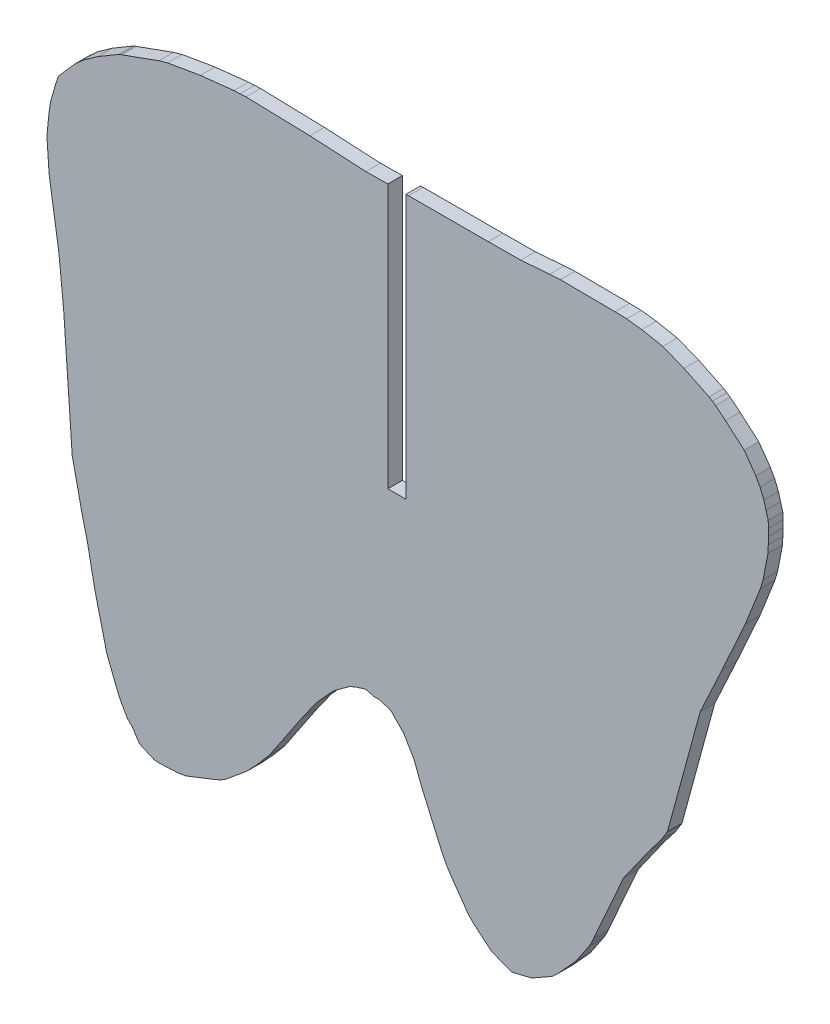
from build123d import *

# Parameters (mm, degrees)
EXTRUDE_1_DEPTH = 2


with BuildPart() as part:
    # Model → Extrude 1 (new body)
    with BuildSketch(Plane.XY):
        Polygon((-6154.0155, 147.3107), (-6153.9786, 148.3382), (-6154.0006, 149.2709), (-6154.0227, 150.2036), (-6154.3248, 151.2813), (-6154.627, 152.359), (-6155.1529, 153.6331), (-6155.7398, 154.6803), (-6157.3282, 156.9238), (-6159.8905, 159.1452), (-6161.2616, 160.2672), (-6161.712, 160.5626), (-6162.1623, 160.8581), (-6165.6062, 162.5244), (-6168.5288, 163.6722), (-6171.4089, 164.2268), (-6173.4835, 164.478), (-6175.0912, 164.5199), (-6182.5921, 164.5797), (-6184.0721, 164.4899), (-6188.0426, 164.1824), (-6192.5081, 164.1544), (-6203.4691, 164.1391), (-6203.822, 164.1358), (-6203.822, 127.8223), (-6204.072, 127.8223), (-6206.072, 127.8223), (-6206.322, 127.8223), (-6206.322, 164.1123), (-6209.3314, 164.084), (-6217.0414, 164.4924), (-6225.8253, 164.733), (-6226.6393, 164.6966), (-6227.4737, 164.6607), (-6232.0853, 164.158), (-6236.5897, 163.3913), (-6237.7896, 163.0485), (-6242.8884, 161.2083), (-6243.0811, 161.1346), (-6243.274, 161.0609), (-6243.3341, 161.0323), (-6246.2064, 159.3331), (-6248.2147, 157.9072), (-6249.398, 156.8311), (-6251.5172, 154.4147), (-6251.589, 154.2861), (-6251.6609, 154.1575), (-6251.8158, 153.6917), (-6251.9706, 153.226), (-6252.7059, 150.6364), (-6252.8126, 149.8839), (-6252.9194, 149.1313), (-6253.1862, 146.377), (-6252.8824, 141.9964), (-6251.524, 133.1949), (-6250.873, 126.6863), (-6249.7071, 110.0764), (-6248.316, 103.6791), (-6247.6264, 100.8887), (-6246.5821, 95.5914), (-6244.9372, 88.8372), (-6243.5451, 85.3187), (-6243.2999, 84.76), (-6243.0548, 84.2012), (-6242.5921, 83.4012), (-6242.1296, 82.6011), (-6241.4365, 81.9056), (-6240.4558, 80.3795), (-6238.3983, 79.4847), (-6237.6107, 79.4494), (-6235.1811, 79.5682), (-6234.0628, 79.762), (-6229.9234, 81.3853), (-6229.2074, 81.7188), (-6228.6725, 82.045), (-6225.6853, 84.5183), (-6224.186, 86.1146), (-6222.5407, 88.0587), (-6217.9764, 94.8635), (-6216.0777, 97.5102), (-6214.2765, 99.5002), (-6213.9505, 99.8283), (-6213.6247, 100.1564), (-6211.6545, 101.5873), (-6211.2418, 101.7911), (-6210.8289, 101.9949), (-6209.3736, 102.4271), (-6208.1681, 102.1304), (-6207.45, 102.1539), (-6207.1219, 102.0301), (-6206.7939, 101.9063), (-6206.2296, 101.7858), (-6205.7345, 101.4787), (-6205.356, 101.0573), (-6204.1229, 99.7884), (-6203.775, 99.1929), (-6202.7293, 97.4183), (-6201.6593, 94.6303), (-6198.9002, 88.3298), (-6198.2528, 87.0506), (-6197.9356, 86.5573), (-6197.6186, 86.0639), (-6195.2071, 82.6354), (-6194.836, 82.2664), (-6194.4651, 81.8974), (-6192.0433, 79.8631), (-6189.3167, 78.8222), (-6189.2384, 78.8111), (-6186.836, 79.3912), (-6186.6461, 79.4494), (-6186.456, 79.5076), (-6184.0407, 80.8813), (-6183.7829, 81.0062), (-6182.7904, 81.9431), (-6180.4496, 84.5356), (-6178.6602, 87.2004), (-6178.3287, 87.7568), (-6178.1576, 88.1345), (-6177.9863, 88.5123), (-6173.9011, 97.7038), (-6170.3692, 102.7006), (-6168.7713, 104.7708), (-6167.8822, 106.2028), (-6163.3753, 122.7467), (-6160.3479, 129.2778), (-6157.1707, 136.2986), (-6155.0881, 141.5758), (-6154.7314, 142.7786), (-6154.0525, 146.2833), align=None)
    extrude(amount=EXTRUDE_1_DEPTH)


solid = part.part
